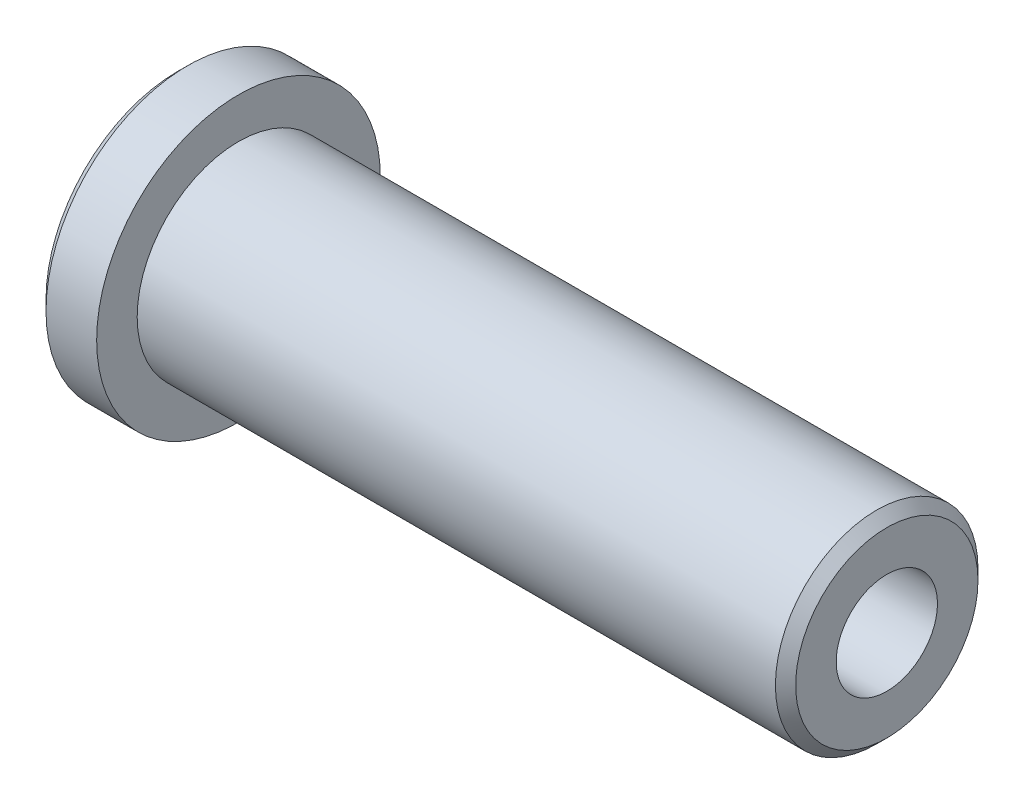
from build123d import *

# Parameters (mm, degrees)
ESQUISSE1_R             = 5
BASE_EXTRUSION_DEPTH    = 32
ESQUISSE2_R             = 7
BOSS_EXTRU_1_DEPTH      = 3
CHANFREIN1_SIZE         = 0.5
ENL_V_MAT_EXTRU_1_DEPTH = 6
ESQUISSE4_R             = 2.5
ENL_V_MAT_EXTRU_2_DEPTH = 22


with BuildPart() as part:
    # Esquisse1 → Base-Extrusion (new body)
    with BuildSketch(Plane(origin=(0, 0, 0), x_dir=(0, 0, -1), z_dir=(1, 0, 0))):
        Circle(ESQUISSE1_R)
    extrude(amount=BASE_EXTRUSION_DEPTH)

    # Esquisse2 → Boss.-Extru.1 (add)
    with BuildSketch(Plane(origin=(0, 0, 0), x_dir=(0, 0, -1), z_dir=(1, 0, 0))):
        Circle(ESQUISSE2_R)
    extrude(amount=-BOSS_EXTRU_1_DEPTH)

    # Chanfrein1
    chanfrein1_edges = [part.edges().sort_by_distance(p)[0] for p in [
        (-3, 0, 7),
        (32, 0, 5),
    ]]
    chamfer(chanfrein1_edges, length=CHANFREIN1_SIZE)

    # Esquisse3 → Enl_v. mat.-Extru.1 (cut)
    with BuildSketch(Plane.ZY.offset(3)):
        Polygon((1.443375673, -2.5), (2.886751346, 0), (1.443375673, 2.5), (-1.443375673, 2.5), (-2.886751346, 0), (-1.443375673, -2.5), align=None)
    extrude(amount=-ENL_V_MAT_EXTRU_1_DEPTH, mode=Mode.SUBTRACT)

    # Esquisse4 → Enl_v. mat.-Extru.2 (cut)
    with BuildSketch(Plane(origin=(32, 0, 0), x_dir=(0, 0, -1), z_dir=(1, 0, 0))):
        Circle(ESQUISSE4_R)
    extrude(amount=-ENL_V_MAT_EXTRU_2_DEPTH, mode=Mode.SUBTRACT)


solid = part.part
